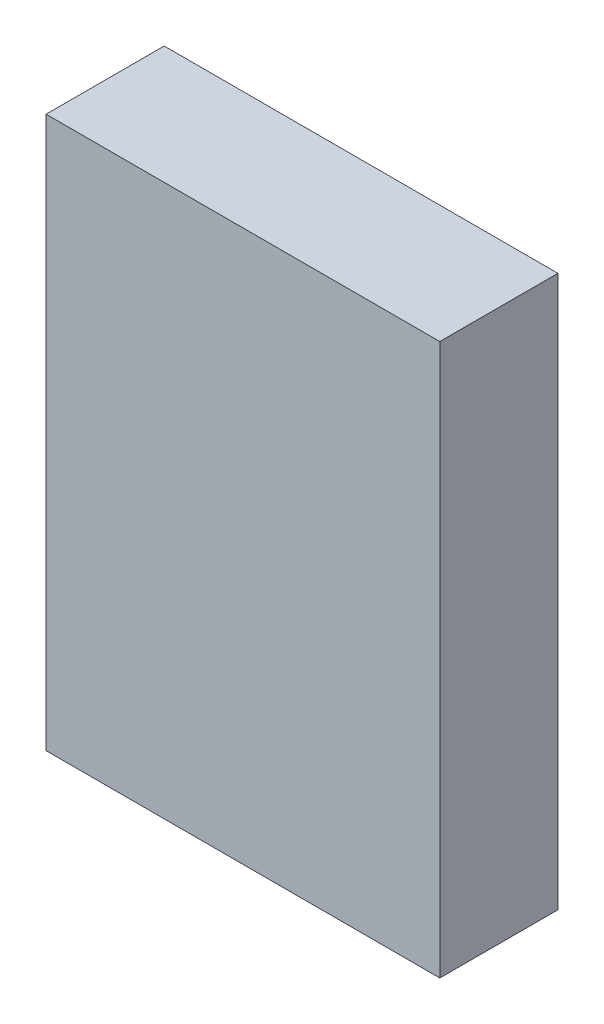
ISO-10303-21;
HEADER;
FILE_DESCRIPTION(('STEP AP214'),'2;1');
FILE_NAME('part.step','',(''),(''),'','','');
FILE_SCHEMA(('AUTOMOTIVE_DESIGN { 1 0 10303 214 1 1 1 1 }'));
ENDSEC;
DATA;
#1=APPLICATION_CONTEXT('core data for automotive mechanical design processes');
#2=APPLICATION_PROTOCOL_DEFINITION('international standard','automotive_design',2000,#1);
#3=PRODUCT_CONTEXT('',#1,'mechanical');
#4=PRODUCT('Part','Part','',(#3));
#5=PRODUCT_RELATED_PRODUCT_CATEGORY('part','',(#4));
#6=PRODUCT_DEFINITION_FORMATION('','',#4);
#7=PRODUCT_DEFINITION_CONTEXT('part definition',#1,'design');
#8=PRODUCT_DEFINITION('design','',#6,#7);
#9=PRODUCT_DEFINITION_SHAPE('','',#8);
#10=(LENGTH_UNIT() NAMED_UNIT(*) SI_UNIT(.MILLI.,.METRE.));
#11=(NAMED_UNIT(*) PLANE_ANGLE_UNIT() SI_UNIT($,.RADIAN.));
#12=(NAMED_UNIT(*) SI_UNIT($,.STERADIAN.) SOLID_ANGLE_UNIT());
#13=UNCERTAINTY_MEASURE_WITH_UNIT(LENGTH_MEASURE(1.E-05),#10,'distance_accuracy_value','');
#14=(GEOMETRIC_REPRESENTATION_CONTEXT(3) GLOBAL_UNCERTAINTY_ASSIGNED_CONTEXT((#13)) GLOBAL_UNIT_ASSIGNED_CONTEXT((#10,
#11,#12)) REPRESENTATION_CONTEXT('',''));
#15=CARTESIAN_POINT('',(0.,0.,0.));
#16=DIRECTION('',(0.,0.,1.));
#17=DIRECTION('',(1.,0.,0.));
#18=AXIS2_PLACEMENT_3D('',#15,#16,#17);
#19=CARTESIAN_POINT('',(10.,28.,-3.));
#20=DIRECTION('',(-1.,0.,0.));
#21=DIRECTION('',(0.,0.,1.));
#22=AXIS2_PLACEMENT_3D('',#19,#20,#21);
#23=PLANE('',#22);
#24=DIRECTION('',(0.,0.,-1.));
#25=VECTOR('',#24,1.);
#26=CARTESIAN_POINT('',(10.,0.,-3.));
#27=LINE('',#26,#25);
#28=CARTESIAN_POINT('',(10.,0.,3.));
#29=VERTEX_POINT('',#28);
#30=CARTESIAN_POINT('',(10.,0.,-3.));
#31=VERTEX_POINT('',#30);
#32=EDGE_CURVE('E141',#29,#31,#27,.T.);
#33=ORIENTED_EDGE('',*,*,#32,.T.);
#34=DIRECTION('',(0.,-1.,0.));
#35=VECTOR('',#34,1.);
#36=CARTESIAN_POINT('',(10.,28.,-3.));
#37=LINE('',#36,#35);
#38=CARTESIAN_POINT('',(10.,28.,-3.));
#39=VERTEX_POINT('',#38);
#40=EDGE_CURVE('E11',#39,#31,#37,.T.);
#41=ORIENTED_EDGE('',*,*,#40,.F.);
#42=DIRECTION('',(0.,0.,-1.));
#43=VECTOR('',#42,1.);
#44=CARTESIAN_POINT('',(10.,28.,-3.));
#45=LINE('',#44,#43);
#46=CARTESIAN_POINT('',(10.,28.,3.));
#47=VERTEX_POINT('',#46);
#48=EDGE_CURVE('E145',#47,#39,#45,.T.);
#49=ORIENTED_EDGE('',*,*,#48,.F.);
#50=DIRECTION('',(0.,-1.,0.));
#51=VECTOR('',#50,1.);
#52=CARTESIAN_POINT('',(10.,28.,3.));
#53=LINE('',#52,#51);
#54=EDGE_CURVE('E151',#47,#29,#53,.T.);
#55=ORIENTED_EDGE('',*,*,#54,.T.);
#56=EDGE_LOOP('',(#33,#41,#49,#55));
#57=FACE_BOUND('',#56,.T.);
#58=ADVANCED_FACE('F33',(#57),#23,.F.);
#59=CARTESIAN_POINT('',(-10.,28.,-3.));
#60=DIRECTION('',(0.,0.,1.));
#61=DIRECTION('',(1.,0.,0.));
#62=AXIS2_PLACEMENT_3D('',#59,#60,#61);
#63=PLANE('',#62);
#64=DIRECTION('',(-1.,0.,0.));
#65=VECTOR('',#64,1.);
#66=CARTESIAN_POINT('',(-10.,0.,-3.));
#67=LINE('',#66,#65);
#68=CARTESIAN_POINT('',(-10.,0.,-3.));
#69=VERTEX_POINT('',#68);
#70=EDGE_CURVE('E154',#31,#69,#67,.T.);
#71=ORIENTED_EDGE('',*,*,#70,.T.);
#72=DIRECTION('',(0.,-1.,0.));
#73=VECTOR('',#72,1.);
#74=CARTESIAN_POINT('',(-10.,28.,-3.));
#75=LINE('',#74,#73);
#76=CARTESIAN_POINT('',(-10.,28.,-3.));
#77=VERTEX_POINT('',#76);
#78=EDGE_CURVE('E40',#77,#69,#75,.T.);
#79=ORIENTED_EDGE('',*,*,#78,.F.);
#80=DIRECTION('',(-1.,0.,0.));
#81=VECTOR('',#80,1.);
#82=CARTESIAN_POINT('',(-10.,28.,-3.));
#83=LINE('',#82,#81);
#84=EDGE_CURVE('E84',#39,#77,#83,.T.);
#85=ORIENTED_EDGE('',*,*,#84,.F.);
#86=ORIENTED_EDGE('',*,*,#40,.T.);
#87=EDGE_LOOP('',(#71,#79,#85,#86));
#88=FACE_BOUND('',#87,.T.);
#89=ADVANCED_FACE('F182',(#88),#63,.F.);
#90=CARTESIAN_POINT('',(-10.,28.,-3.));
#91=DIRECTION('',(1.,0.,0.));
#92=DIRECTION('',(0.,0.,-1.));
#93=AXIS2_PLACEMENT_3D('',#90,#91,#92);
#94=PLANE('',#93);
#95=DIRECTION('',(0.,0.,1.));
#96=VECTOR('',#95,1.);
#97=CARTESIAN_POINT('',(-10.,0.,-3.));
#98=LINE('',#97,#96);
#99=CARTESIAN_POINT('',(-10.,0.,3.));
#100=VERTEX_POINT('',#99);
#101=EDGE_CURVE('E156',#69,#100,#98,.T.);
#102=ORIENTED_EDGE('',*,*,#101,.T.);
#103=DIRECTION('',(0.,-1.,0.));
#104=VECTOR('',#103,1.);
#105=CARTESIAN_POINT('',(-10.,28.,3.));
#106=LINE('',#105,#104);
#107=CARTESIAN_POINT('',(-10.,28.,3.));
#108=VERTEX_POINT('',#107);
#109=EDGE_CURVE('E160',#108,#100,#106,.T.);
#110=ORIENTED_EDGE('',*,*,#109,.F.);
#111=DIRECTION('',(0.,0.,1.));
#112=VECTOR('',#111,1.);
#113=CARTESIAN_POINT('',(-10.,28.,-3.));
#114=LINE('',#113,#112);
#115=EDGE_CURVE('E148',#77,#108,#114,.T.);
#116=ORIENTED_EDGE('',*,*,#115,.F.);
#117=ORIENTED_EDGE('',*,*,#78,.T.);
#118=EDGE_LOOP('',(#102,#110,#116,#117));
#119=FACE_BOUND('',#118,.T.);
#120=ADVANCED_FACE('F165',(#119),#94,.F.);
#121=CARTESIAN_POINT('',(-10.,28.,3.));
#122=DIRECTION('',(0.,0.,-1.));
#123=DIRECTION('',(-1.,0.,0.));
#124=AXIS2_PLACEMENT_3D('',#121,#122,#123);
#125=PLANE('',#124);
#126=DIRECTION('',(1.,0.,0.));
#127=VECTOR('',#126,1.);
#128=CARTESIAN_POINT('',(-10.,0.,3.));
#129=LINE('',#128,#127);
#130=EDGE_CURVE('E77',#100,#29,#129,.T.);
#131=ORIENTED_EDGE('',*,*,#130,.T.);
#132=ORIENTED_EDGE('',*,*,#54,.F.);
#133=DIRECTION('',(1.,0.,0.));
#134=VECTOR('',#133,1.);
#135=CARTESIAN_POINT('',(-10.,28.,3.));
#136=LINE('',#135,#134);
#137=EDGE_CURVE('E56',#108,#47,#136,.T.);
#138=ORIENTED_EDGE('',*,*,#137,.F.);
#139=ORIENTED_EDGE('',*,*,#109,.T.);
#140=EDGE_LOOP('',(#131,#132,#138,#139));
#141=FACE_BOUND('',#140,.T.);
#142=ADVANCED_FACE('F173',(#141),#125,.F.);
#143=CARTESIAN_POINT('',(10.,28.,3.));
#144=DIRECTION('',(0.,1.,0.));
#145=DIRECTION('',(0.,0.,1.));
#146=AXIS2_PLACEMENT_3D('',#143,#144,#145);
#147=PLANE('',#146);
#148=ORIENTED_EDGE('',*,*,#48,.T.);
#149=ORIENTED_EDGE('',*,*,#84,.T.);
#150=ORIENTED_EDGE('',*,*,#115,.T.);
#151=ORIENTED_EDGE('',*,*,#137,.T.);
#152=EDGE_LOOP('',(#148,#149,#150,#151));
#153=FACE_BOUND('',#152,.T.);
#154=ADVANCED_FACE('F175',(#153),#147,.T.);
#155=CARTESIAN_POINT('',(10.,0.,3.));
#156=DIRECTION('',(0.,1.,0.));
#157=DIRECTION('',(0.,0.,1.));
#158=AXIS2_PLACEMENT_3D('',#155,#156,#157);
#159=PLANE('',#158);
#160=DIRECTION('',(-1.,0.,0.));
#161=VECTOR('',#160,1.);
#162=CARTESIAN_POINT('',(-5.,0.,0.75));
#163=LINE('',#162,#161);
#164=CARTESIAN_POINT('',(5.,0.,0.75));
#165=VERTEX_POINT('',#164);
#166=CARTESIAN_POINT('',(-5.,0.,0.75));
#167=VERTEX_POINT('',#166);
#168=EDGE_CURVE('E135',#165,#167,#163,.T.);
#169=ORIENTED_EDGE('',*,*,#168,.F.);
#170=DIRECTION('',(0.,0.,1.));
#171=VECTOR('',#170,1.);
#172=CARTESIAN_POINT('',(5.,0.,0.75));
#173=LINE('',#172,#171);
#174=CARTESIAN_POINT('',(5.,0.,-0.75));
#175=VERTEX_POINT('',#174);
#176=EDGE_CURVE('E47',#175,#165,#173,.T.);
#177=ORIENTED_EDGE('',*,*,#176,.F.);
#178=DIRECTION('',(1.,0.,0.));
#179=VECTOR('',#178,1.);
#180=CARTESIAN_POINT('',(-5.,0.,-0.75));
#181=LINE('',#180,#179);
#182=CARTESIAN_POINT('',(-5.,0.,-0.75));
#183=VERTEX_POINT('',#182);
#184=EDGE_CURVE('E126',#183,#175,#181,.T.);
#185=ORIENTED_EDGE('',*,*,#184,.F.);
#186=DIRECTION('',(0.,0.,-1.));
#187=VECTOR('',#186,1.);
#188=CARTESIAN_POINT('',(-5.,0.,0.75));
#189=LINE('',#188,#187);
#190=EDGE_CURVE('E129',#167,#183,#189,.T.);
#191=ORIENTED_EDGE('',*,*,#190,.F.);
#192=EDGE_LOOP('',(#169,#177,#185,#191));
#193=FACE_BOUND('',#192,.T.);
#194=ORIENTED_EDGE('',*,*,#32,.F.);
#195=ORIENTED_EDGE('',*,*,#130,.F.);
#196=ORIENTED_EDGE('',*,*,#101,.F.);
#197=ORIENTED_EDGE('',*,*,#70,.F.);
#198=EDGE_LOOP('',(#194,#195,#196,#197));
#199=FACE_BOUND('',#198,.T.);
#200=ADVANCED_FACE('F169',(#193,#199),#159,.F.);
#201=CARTESIAN_POINT('',(5.,25.,0.75));
#202=DIRECTION('',(1.,0.,0.));
#203=DIRECTION('',(0.,0.,-1.));
#204=AXIS2_PLACEMENT_3D('',#201,#202,#203);
#205=PLANE('',#204);
#206=ORIENTED_EDGE('',*,*,#176,.T.);
#207=DIRECTION('',(0.,-1.,0.));
#208=VECTOR('',#207,1.);
#209=CARTESIAN_POINT('',(5.,25.,0.75));
#210=LINE('',#209,#208);
#211=CARTESIAN_POINT('',(5.,25.,0.75));
#212=VERTEX_POINT('',#211);
#213=EDGE_CURVE('E104',#212,#165,#210,.T.);
#214=ORIENTED_EDGE('',*,*,#213,.F.);
#215=DIRECTION('',(0.,0.,1.));
#216=VECTOR('',#215,1.);
#217=CARTESIAN_POINT('',(5.,25.,0.75));
#218=LINE('',#217,#216);
#219=CARTESIAN_POINT('',(5.,25.,-0.75));
#220=VERTEX_POINT('',#219);
#221=EDGE_CURVE('E108',#220,#212,#218,.T.);
#222=ORIENTED_EDGE('',*,*,#221,.F.);
#223=DIRECTION('',(0.,-1.,0.));
#224=VECTOR('',#223,1.);
#225=CARTESIAN_POINT('',(5.,25.,-0.75));
#226=LINE('',#225,#224);
#227=EDGE_CURVE('E139',#220,#175,#226,.T.);
#228=ORIENTED_EDGE('',*,*,#227,.T.);
#229=EDGE_LOOP('',(#206,#214,#222,#228));
#230=FACE_BOUND('',#229,.T.);
#231=ADVANCED_FACE('F106',(#230),#205,.F.);
#232=CARTESIAN_POINT('',(-5.,25.,-0.75));
#233=DIRECTION('',(0.,0.,-1.));
#234=DIRECTION('',(-1.,0.,0.));
#235=AXIS2_PLACEMENT_3D('',#232,#233,#234);
#236=PLANE('',#235);
#237=ORIENTED_EDGE('',*,*,#184,.T.);
#238=ORIENTED_EDGE('',*,*,#227,.F.);
#239=DIRECTION('',(1.,0.,0.));
#240=VECTOR('',#239,1.);
#241=CARTESIAN_POINT('',(-5.,25.,-0.75));
#242=LINE('',#241,#240);
#243=CARTESIAN_POINT('',(-5.,25.,-0.75));
#244=VERTEX_POINT('',#243);
#245=EDGE_CURVE('E114',#244,#220,#242,.T.);
#246=ORIENTED_EDGE('',*,*,#245,.F.);
#247=DIRECTION('',(0.,-1.,0.));
#248=VECTOR('',#247,1.);
#249=CARTESIAN_POINT('',(-5.,25.,-0.75));
#250=LINE('',#249,#248);
#251=EDGE_CURVE('E142',#244,#183,#250,.T.);
#252=ORIENTED_EDGE('',*,*,#251,.T.);
#253=EDGE_LOOP('',(#237,#238,#246,#252));
#254=FACE_BOUND('',#253,.T.);
#255=ADVANCED_FACE('F222',(#254),#236,.F.);
#256=CARTESIAN_POINT('',(-5.,25.,0.75));
#257=DIRECTION('',(-1.,0.,0.));
#258=DIRECTION('',(0.,0.,1.));
#259=AXIS2_PLACEMENT_3D('',#256,#257,#258);
#260=PLANE('',#259);
#261=ORIENTED_EDGE('',*,*,#190,.T.);
#262=ORIENTED_EDGE('',*,*,#251,.F.);
#263=DIRECTION('',(0.,0.,-1.));
#264=VECTOR('',#263,1.);
#265=CARTESIAN_POINT('',(-5.,25.,0.75));
#266=LINE('',#265,#264);
#267=CARTESIAN_POINT('',(-5.,25.,0.75));
#268=VERTEX_POINT('',#267);
#269=EDGE_CURVE('E122',#268,#244,#266,.T.);
#270=ORIENTED_EDGE('',*,*,#269,.F.);
#271=DIRECTION('',(0.,-1.,0.));
#272=VECTOR('',#271,1.);
#273=CARTESIAN_POINT('',(-5.,25.,0.75));
#274=LINE('',#273,#272);
#275=EDGE_CURVE('E113',#268,#167,#274,.T.);
#276=ORIENTED_EDGE('',*,*,#275,.T.);
#277=EDGE_LOOP('',(#261,#262,#270,#276));
#278=FACE_BOUND('',#277,.T.);
#279=ADVANCED_FACE('F231',(#278),#260,.F.);
#280=CARTESIAN_POINT('',(-5.,25.,0.75));
#281=DIRECTION('',(0.,0.,1.));
#282=DIRECTION('',(1.,0.,0.));
#283=AXIS2_PLACEMENT_3D('',#280,#281,#282);
#284=PLANE('',#283);
#285=ORIENTED_EDGE('',*,*,#168,.T.);
#286=ORIENTED_EDGE('',*,*,#275,.F.);
#287=DIRECTION('',(-1.,0.,0.));
#288=VECTOR('',#287,1.);
#289=CARTESIAN_POINT('',(-5.,25.,0.75));
#290=LINE('',#289,#288);
#291=EDGE_CURVE('E117',#212,#268,#290,.T.);
#292=ORIENTED_EDGE('',*,*,#291,.F.);
#293=ORIENTED_EDGE('',*,*,#213,.T.);
#294=EDGE_LOOP('',(#285,#286,#292,#293));
#295=FACE_BOUND('',#294,.T.);
#296=ADVANCED_FACE('F118',(#295),#284,.F.);
#297=CARTESIAN_POINT('',(5.,25.,-0.75));
#298=DIRECTION('',(0.,-1.,0.));
#299=DIRECTION('',(0.,0.,-1.));
#300=AXIS2_PLACEMENT_3D('',#297,#298,#299);
#301=PLANE('',#300);
#302=ORIENTED_EDGE('',*,*,#221,.T.);
#303=ORIENTED_EDGE('',*,*,#291,.T.);
#304=ORIENTED_EDGE('',*,*,#269,.T.);
#305=ORIENTED_EDGE('',*,*,#245,.T.);
#306=EDGE_LOOP('',(#302,#303,#304,#305));
#307=FACE_BOUND('',#306,.T.);
#308=ADVANCED_FACE('F124',(#307),#301,.T.);
#309=CLOSED_SHELL('',(#58,#89,#120,#142,#154,#200,#231,#255,#279,#296,#308));
#310=MANIFOLD_SOLID_BREP('B2',#309);
#311=ADVANCED_BREP_SHAPE_REPRESENTATION('',(#18,#310),#14);
#312=SHAPE_DEFINITION_REPRESENTATION(#9,#311);
ENDSEC;
END-ISO-10303-21;
